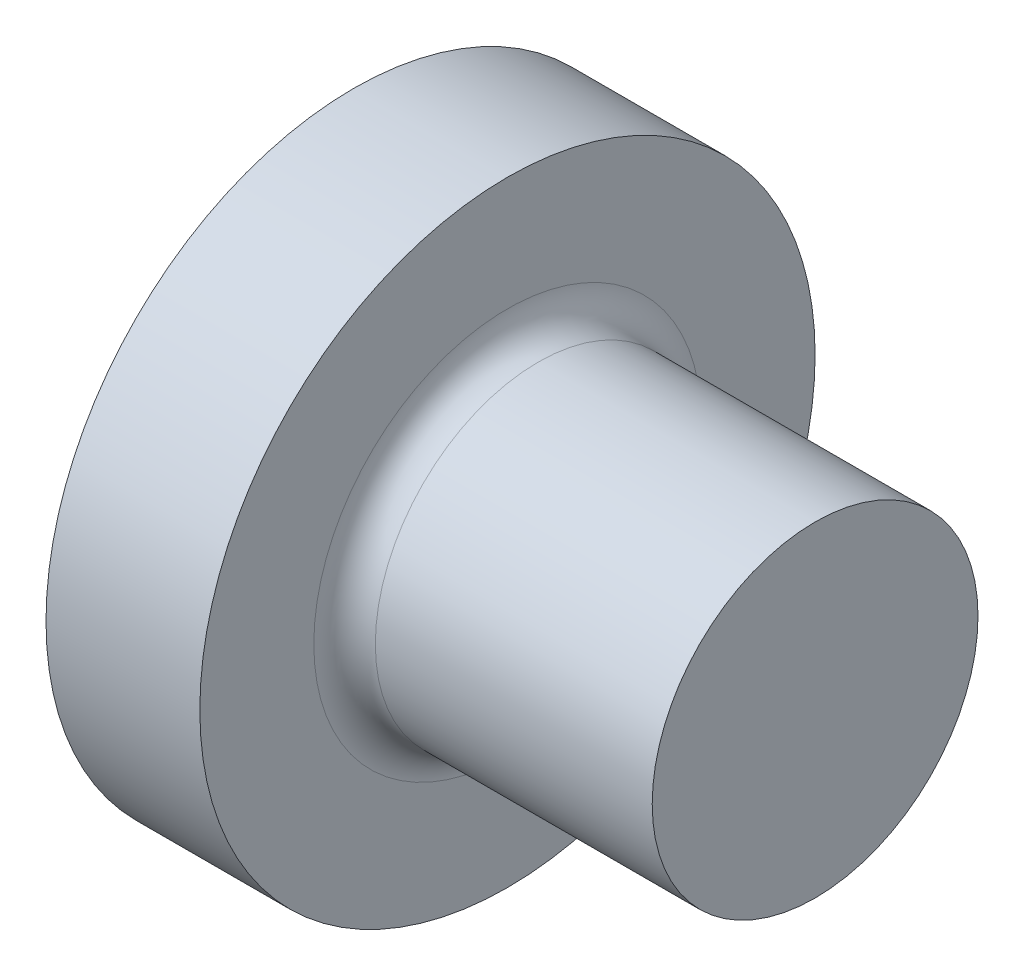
ISO-10303-21;
HEADER;
FILE_DESCRIPTION(('STEP AP214'),'2;1');
FILE_NAME('part.step','',(''),(''),'','','');
FILE_SCHEMA(('AUTOMOTIVE_DESIGN { 1 0 10303 214 1 1 1 1 }'));
ENDSEC;
DATA;
#1=APPLICATION_CONTEXT('core data for automotive mechanical design processes');
#2=APPLICATION_PROTOCOL_DEFINITION('international standard','automotive_design',2000,#1);
#3=PRODUCT_CONTEXT('',#1,'mechanical');
#4=PRODUCT('Part','Part','',(#3));
#5=PRODUCT_RELATED_PRODUCT_CATEGORY('part','',(#4));
#6=PRODUCT_DEFINITION_FORMATION('','',#4);
#7=PRODUCT_DEFINITION_CONTEXT('part definition',#1,'design');
#8=PRODUCT_DEFINITION('design','',#6,#7);
#9=PRODUCT_DEFINITION_SHAPE('','',#8);
#10=(LENGTH_UNIT() NAMED_UNIT(*) SI_UNIT(.MILLI.,.METRE.));
#11=(NAMED_UNIT(*) PLANE_ANGLE_UNIT() SI_UNIT($,.RADIAN.));
#12=(NAMED_UNIT(*) SI_UNIT($,.STERADIAN.) SOLID_ANGLE_UNIT());
#13=UNCERTAINTY_MEASURE_WITH_UNIT(LENGTH_MEASURE(1.E-05),#10,'distance_accuracy_value','');
#14=(GEOMETRIC_REPRESENTATION_CONTEXT(3) GLOBAL_UNCERTAINTY_ASSIGNED_CONTEXT((#13)) GLOBAL_UNIT_ASSIGNED_CONTEXT((#10,
#11,#12)) REPRESENTATION_CONTEXT('',''));
#15=CARTESIAN_POINT('',(0.,0.,0.));
#16=DIRECTION('',(0.,0.,1.));
#17=DIRECTION('',(1.,0.,0.));
#18=AXIS2_PLACEMENT_3D('',#15,#16,#17);
#19=CARTESIAN_POINT('',(-38.1,25.4,0.));
#20=DIRECTION('',(-1.,0.,0.));
#21=DIRECTION('',(0.,0.,1.));
#22=AXIS2_PLACEMENT_3D('',#19,#20,#21);
#23=PLANE('',#22);
#24=CARTESIAN_POINT('',(-38.1,0.,0.));
#25=DIRECTION('',(1.,0.,0.));
#26=DIRECTION('',(0.,0.,-1.));
#27=AXIS2_PLACEMENT_3D('',#24,#25,#26);
#28=CIRCLE('',#27,25.4);
#29=CARTESIAN_POINT('',(-38.1,0.,-25.4));
#30=VERTEX_POINT('',#29);
#31=EDGE_CURVE('E10',#30,#30,#28,.T.);
#32=ORIENTED_EDGE('',*,*,#31,.F.);
#33=EDGE_LOOP('',(#32));
#34=FACE_BOUND('',#33,.T.);
#35=ADVANCED_FACE('F33',(#34),#23,.T.);
#36=CARTESIAN_POINT('',(52.5109342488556,0.,0.));
#37=DIRECTION('',(1.,0.,0.));
#38=DIRECTION('',(0.,0.,-1.));
#39=AXIS2_PLACEMENT_3D('',#36,#37,#38);
#40=CYLINDRICAL_SURFACE('',#39,25.4);
#41=ORIENTED_EDGE('',*,*,#31,.T.);
#42=EDGE_LOOP('',(#41));
#43=FACE_BOUND('',#42,.T.);
#44=CARTESIAN_POINT('',(-25.4,0.,0.));
#45=DIRECTION('',(1.,0.,0.));
#46=DIRECTION('',(0.,0.,-1.));
#47=AXIS2_PLACEMENT_3D('',#44,#45,#46);
#48=CIRCLE('',#47,25.4);
#49=CARTESIAN_POINT('',(-25.4,0.,-25.4));
#50=VERTEX_POINT('',#49);
#51=EDGE_CURVE('E39',#50,#50,#48,.T.);
#52=ORIENTED_EDGE('',*,*,#51,.F.);
#53=EDGE_LOOP('',(#52));
#54=FACE_BOUND('',#53,.T.);
#55=ADVANCED_FACE('F72',(#43,#54),#40,.T.);
#56=CARTESIAN_POINT('',(-25.4,15.9896670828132,0.));
#57=DIRECTION('',(1.,0.,0.));
#58=DIRECTION('',(0.,0.,-1.));
#59=AXIS2_PLACEMENT_3D('',#56,#57,#58);
#60=PLANE('',#59);
#61=ORIENTED_EDGE('',*,*,#51,.T.);
#62=EDGE_LOOP('',(#61));
#63=FACE_BOUND('',#62,.T.);
#64=CARTESIAN_POINT('',(-25.4,0.,0.));
#65=DIRECTION('',(1.,0.,0.));
#66=DIRECTION('',(0.,0.,-1.));
#67=AXIS2_PLACEMENT_3D('',#64,#65,#66);
#68=CIRCLE('',#67,15.9896670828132);
#69=CARTESIAN_POINT('',(-25.4,0.,-15.9896670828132));
#70=VERTEX_POINT('',#69);
#71=EDGE_CURVE('E43',#70,#70,#68,.T.);
#72=ORIENTED_EDGE('',*,*,#71,.F.);
#73=EDGE_LOOP('',(#72));
#74=FACE_BOUND('',#73,.T.);
#75=ADVANCED_FACE('F68',(#63,#74),#60,.T.);
#76=CARTESIAN_POINT('',(-22.86,0.,0.));
#77=DIRECTION('',(1.,0.,0.));
#78=DIRECTION('',(0.,0.,-1.));
#79=AXIS2_PLACEMENT_3D('',#76,#77,#78);
#80=TOROIDAL_SURFACE('',#79,15.9896670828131,2.54);
#81=ORIENTED_EDGE('',*,*,#71,.T.);
#82=EDGE_LOOP('',(#81));
#83=FACE_BOUND('',#82,.T.);
#84=CARTESIAN_POINT('',(-22.86,0.,0.));
#85=DIRECTION('',(1.,0.,0.));
#86=DIRECTION('',(0.,0.,-1.));
#87=AXIS2_PLACEMENT_3D('',#84,#85,#86);
#88=CIRCLE('',#87,13.4496670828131);
#89=CARTESIAN_POINT('',(-22.86,0.,-13.4496670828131));
#90=VERTEX_POINT('',#89);
#91=EDGE_CURVE('E47',#90,#90,#88,.T.);
#92=ORIENTED_EDGE('',*,*,#91,.F.);
#93=EDGE_LOOP('',(#92));
#94=FACE_BOUND('',#93,.T.);
#95=ADVANCED_FACE('F60',(#83,#94),#80,.F.);
#96=CARTESIAN_POINT('',(52.5109342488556,0.,0.));
#97=DIRECTION('',(1.,0.,0.));
#98=DIRECTION('',(0.,0.,-1.));
#99=AXIS2_PLACEMENT_3D('',#96,#97,#98);
#100=CYLINDRICAL_SURFACE('',#99,13.4496670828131);
#101=ORIENTED_EDGE('',*,*,#91,.T.);
#102=EDGE_LOOP('',(#101));
#103=FACE_BOUND('',#102,.T.);
#104=CARTESIAN_POINT('',(0.,0.,0.));
#105=DIRECTION('',(1.,0.,0.));
#106=DIRECTION('',(0.,0.,-1.));
#107=AXIS2_PLACEMENT_3D('',#104,#105,#106);
#108=CIRCLE('',#107,13.4496670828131);
#109=CARTESIAN_POINT('',(0.,0.,-13.4496670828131));
#110=VERTEX_POINT('',#109);
#111=EDGE_CURVE('E52',#110,#110,#108,.T.);
#112=ORIENTED_EDGE('',*,*,#111,.F.);
#113=EDGE_LOOP('',(#112));
#114=FACE_BOUND('',#113,.T.);
#115=ADVANCED_FACE('F58',(#103,#114),#100,.T.);
#116=CARTESIAN_POINT('',(0.,0.749667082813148,0.));
#117=DIRECTION('',(1.,0.,0.));
#118=DIRECTION('',(0.,0.,-1.));
#119=AXIS2_PLACEMENT_3D('',#116,#117,#118);
#120=PLANE('',#119);
#121=ORIENTED_EDGE('',*,*,#111,.T.);
#122=EDGE_LOOP('',(#121));
#123=FACE_BOUND('',#122,.T.);
#124=ADVANCED_FACE('F56',(#123),#120,.T.);
#125=CLOSED_SHELL('',(#35,#55,#75,#95,#115,#124));
#126=MANIFOLD_SOLID_BREP('B2',#125);
#127=ADVANCED_BREP_SHAPE_REPRESENTATION('',(#18,#126),#14);
#128=SHAPE_DEFINITION_REPRESENTATION(#9,#127);
ENDSEC;
END-ISO-10303-21;
